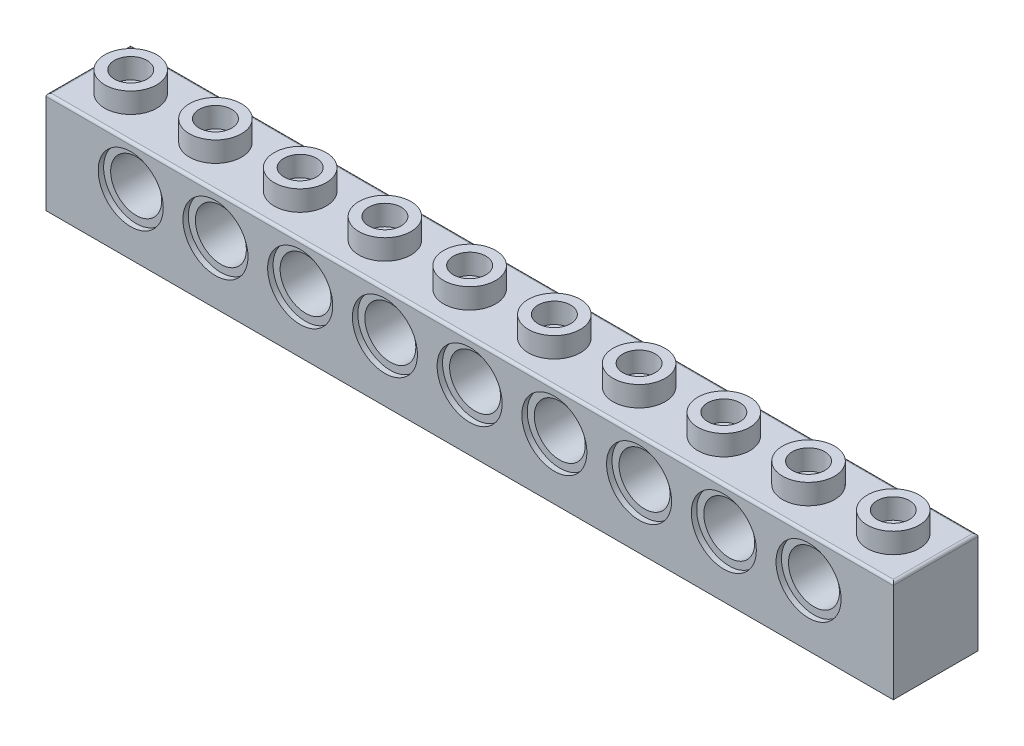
from build123d import *

# Parameters (mm, degrees)
SKETCH1_W                = 79.375
SKETCH1_H                = 7.9375
BASE_EXTRUDE_DEPTH       = 9.525
SKETCH2_R                = 2.4384
BOSS_EXTRUDE1_DEPTH      = 1.905
LPATTERN4_COUNT          = 10
LPATTERN4_PITCH          = 7.9375
SHELL1_T                 = -1.5875
SKETCH5_R                = 2.3876
CUT_EXTRUDE1_DEPTH       = 43.056467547
SKETCH6_R                = 3.048
CBORE1_DEPTH             = 0.508
CBORE2_START             = -0.762
SKETCH7_R                = 3.048
CBORE2_DEPTH             = 0.762
BOSS_EXTRUDE_THIN1_START = -5.842
SKETCH8_R                = 3.3876
SKETCH8_R_2              = 2.3876
BOSS_EXTRUDE_THIN1_DEPTH = 4.7625
LPATTERN7_COUNT          = 9
LPATTERN7_PITCH          = 7.9375
INSDOT2_REACH            = 43.491
INSDOT2_END_RADIUS       = 3.3876
SKETCH4_R                = 1.27
LPATTERN6_COUNT          = 9
LPATTERN6_PITCH          = 7.9375
CUT_EXTRUDE2_START       = -1.905
SKETCH10_R               = 1.524
CUT_EXTRUDE2_DEPTH       = 1.905
LPATTERN8_COUNT          = 10
LPATTERN8_PITCH          = 7.9375
FILLET1_R                = 0.254


with BuildPart() as part:
    # Sketch1 → Base-Extrude (new body)
    with BuildSketch(Plane(origin=(0, 0, 0), x_dir=(1, 0, 0), z_dir=(0, 1, 0))):
        Rectangle(SKETCH1_W, SKETCH1_H)
    extrude(amount=BASE_EXTRUDE_DEPTH)

    # Sketch2 → Boss-Extrude1 (add)
    with BuildSketch(Plane(origin=(0, 9.525, 0), x_dir=(-1, 0, 0), z_dir=(0, 1, 0))):
        with Locations(Location((35.71875, 0, 0), (0, 0, 270))):
            Circle(SKETCH2_R)
    boss_extrude1 = extrude(amount=BOSS_EXTRUDE1_DEPTH)

    # LPattern4: Boss-Extrude1 ×10
    with Locations(*[(i * LPATTERN4_PITCH, 0, 0) for i in range(1, LPATTERN4_COUNT)]):
        add(boss_extrude1)

    # Shell1
    shell1_openings = [part.faces().sort_by_distance(p)[0] for p in [
        (0, 0, 0),
    ]]
    offset(amount=SHELL1_T, openings=shell1_openings, kind=Kind.INTERSECTION)

    # Sketch5 → Cut-Extrude1 (cut, through all)
    with BuildSketch(Plane.XY.offset(3.96875)):
        with Locations((-31.75, 5.715)):
            Circle(SKETCH5_R)
    cut_extrude1 = extrude(amount=-CUT_EXTRUDE1_DEPTH, mode=Mode.SUBTRACT)

    # Sketch6 → cbore1 (cut)
    with BuildSketch(Plane.XY.offset(3.96875)):
        with Locations((-31.75, 5.715)):
            Circle(SKETCH6_R)
    cbore1 = extrude(amount=-CBORE1_DEPTH, mode=Mode.SUBTRACT)

    # Sketch7 → cbore2 (cut)
    with BuildSketch(Plane(origin=(0, 0, -3.96875), x_dir=(-1, 0, 0), z_dir=(0, 0, -1)).offset(CBORE2_START)):
        with Locations(Location((31.75, 5.715, 0), (0, 0, 180))):
            Circle(SKETCH7_R)
    cbore2 = extrude(amount=CBORE2_DEPTH, mode=Mode.SUBTRACT)

    # Sketch8 → Boss-Extrude-Thin1 (add)
    with BuildSketch(Plane.XY.offset(3.46075).offset(BOSS_EXTRUDE_THIN1_START)):
        with Locations((-31.75, 5.715)):
            Circle(SKETCH8_R)
        with Locations((-31.75, 5.715)):
            Circle(SKETCH8_R_2, mode=Mode.SUBTRACT)
    boss_extrude_thin1 = extrude(amount=BOSS_EXTRUDE_THIN1_DEPTH)

    # LPattern7: Cut-Extrude1, cbore1, cbore2, Boss-Extrude-Thin1 ×9
    with Locations(*[(i * LPATTERN7_PITCH, 0, 0) for i in range(1, LPATTERN7_COUNT)]):
        add(cut_extrude1, mode=Mode.SUBTRACT)
        add(cbore1, mode=Mode.SUBTRACT)
        add(cbore2, mode=Mode.SUBTRACT)
        add(boss_extrude_thin1)

    # InsDot2: up to this cylinder (the profile starts outside it)
    insdot2_end = Plane(origin=(31.75, 5.715, 0), z_dir=(0, 0, 1)) * Cylinder(INSDOT2_END_RADIUS, 94.7572, mode=Mode.PRIVATE)
    # Sketch4 → InsDot2 (add, up to the surface)
    with BuildSketch(Plane.XZ, mode=Mode.PRIVATE) as insdot2_sk1:
        with Locations(Location((31.75, 0, 0), (0, 0, 270))):
            Circle(SKETCH4_R)
    insdot2_tool1 = extrude(insdot2_sk1.sketch, amount=-INSDOT2_REACH, mode=Mode.PRIVATE) - insdot2_end
    insdot2 = insdot2_tool1.solids().sort_by_distance((31.75, 0, 0))[0]
    add(insdot2)

    # LPattern6: InsDot2 ×9
    with Locations(*[(-i * LPATTERN6_PITCH, 0, 0) for i in range(1, LPATTERN6_COUNT)]):
        add(insdot2)

    # Sketch10 → Cut-Extrude2 (cut)
    with BuildSketch(Plane(origin=(0, 11.43, 0), x_dir=(-1, 0, 0), z_dir=(0, 1, 0)).offset(CUT_EXTRUDE2_START)):
        with Locations(Location((35.71875, 0, 0), (0, 0, 90))):
            Circle(SKETCH10_R)
    cut_extrude2 = extrude(amount=CUT_EXTRUDE2_DEPTH, mode=Mode.SUBTRACT)

    # LPattern8: Cut-Extrude2 ×10
    with Locations(*[(i * LPATTERN8_PITCH, 0, 0) for i in range(1, LPATTERN8_COUNT)]):
        add(cut_extrude2, mode=Mode.SUBTRACT)

    # Fillet1
    fillet1_edges = [part.edges().sort_by_distance(p)[0] for p in [
        (39.6875, 9.525, 0),
        (0, 9.525, -3.96875),
        (-39.6875, 9.525, 0),
        (0, 9.525, 3.96875),
    ]]
    fillet(fillet1_edges, radius=FILLET1_R)


solid = part.part
